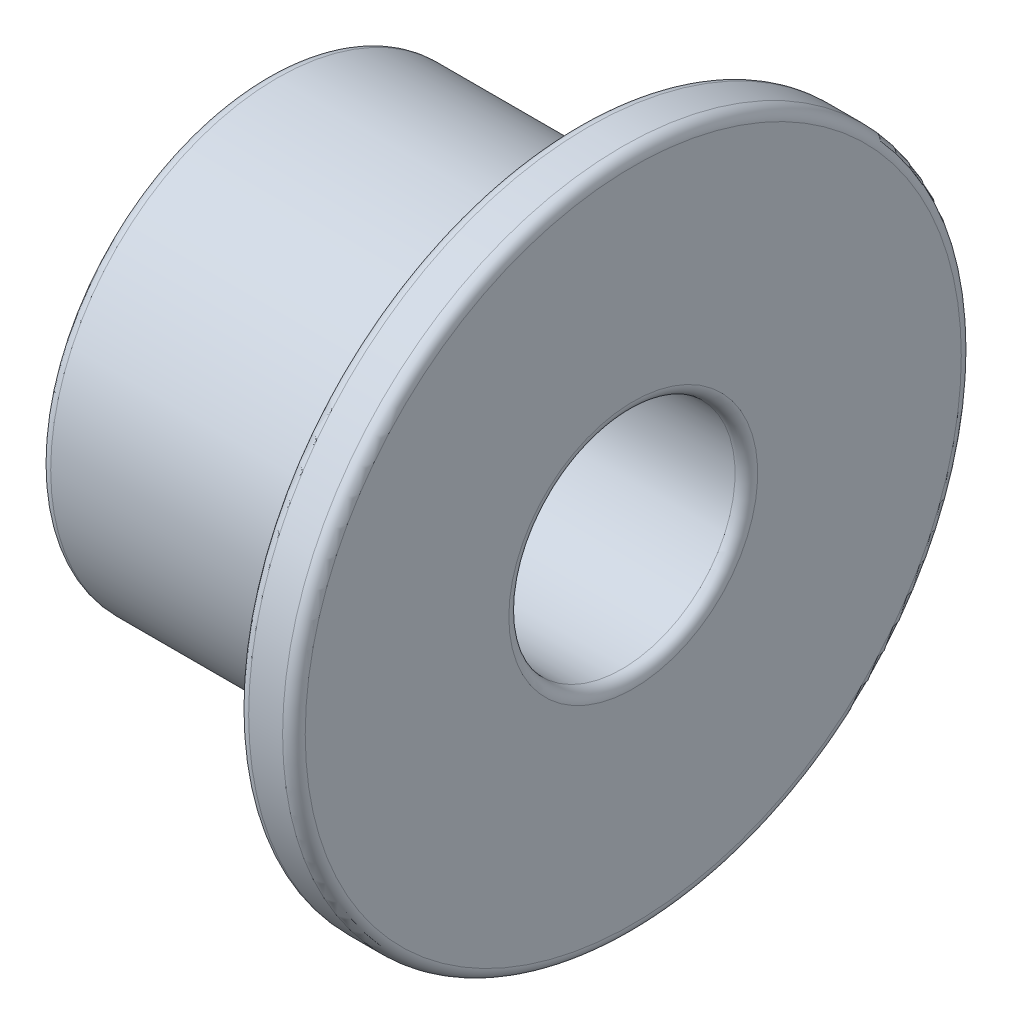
ISO-10303-21;
HEADER;
FILE_DESCRIPTION(('STEP AP214'),'2;1');
FILE_NAME('part.step','',(''),(''),'','','');
FILE_SCHEMA(('AUTOMOTIVE_DESIGN { 1 0 10303 214 1 1 1 1 }'));
ENDSEC;
DATA;
#1=APPLICATION_CONTEXT('core data for automotive mechanical design processes');
#2=APPLICATION_PROTOCOL_DEFINITION('international standard','automotive_design',2000,#1);
#3=PRODUCT_CONTEXT('',#1,'mechanical');
#4=PRODUCT('Part','Part','',(#3));
#5=PRODUCT_RELATED_PRODUCT_CATEGORY('part','',(#4));
#6=PRODUCT_DEFINITION_FORMATION('','',#4);
#7=PRODUCT_DEFINITION_CONTEXT('part definition',#1,'design');
#8=PRODUCT_DEFINITION('design','',#6,#7);
#9=PRODUCT_DEFINITION_SHAPE('','',#8);
#10=(LENGTH_UNIT() NAMED_UNIT(*) SI_UNIT(.MILLI.,.METRE.));
#11=(NAMED_UNIT(*) PLANE_ANGLE_UNIT() SI_UNIT($,.RADIAN.));
#12=(NAMED_UNIT(*) SI_UNIT($,.STERADIAN.) SOLID_ANGLE_UNIT());
#13=UNCERTAINTY_MEASURE_WITH_UNIT(LENGTH_MEASURE(1.E-05),#10,'distance_accuracy_value','');
#14=(GEOMETRIC_REPRESENTATION_CONTEXT(3) GLOBAL_UNCERTAINTY_ASSIGNED_CONTEXT((#13)) GLOBAL_UNIT_ASSIGNED_CONTEXT((#10,
#11,#12)) REPRESENTATION_CONTEXT('',''));
#15=CARTESIAN_POINT('',(0.,0.,0.));
#16=DIRECTION('',(0.,0.,1.));
#17=DIRECTION('',(1.,0.,0.));
#18=AXIS2_PLACEMENT_3D('',#15,#16,#17);
#19=CARTESIAN_POINT('',(0.,4.,0.));
#20=DIRECTION('',(1.,0.,0.));
#21=DIRECTION('',(0.,0.,-1.));
#22=AXIS2_PLACEMENT_3D('',#19,#20,#21);
#23=PLANE('',#22);
#24=CARTESIAN_POINT('',(0.,0.,0.));
#25=DIRECTION('',(1.,0.,0.));
#26=DIRECTION('',(0.,0.,-1.));
#27=AXIS2_PLACEMENT_3D('',#24,#25,#26);
#28=CIRCLE('',#27,2.2);
#29=CARTESIAN_POINT('',(0.,0.,-2.2));
#30=VERTEX_POINT('',#29);
#31=EDGE_CURVE('E60',#30,#30,#28,.T.);
#32=ORIENTED_EDGE('',*,*,#31,.T.);
#33=EDGE_LOOP('',(#32));
#34=FACE_BOUND('',#33,.T.);
#35=CARTESIAN_POINT('',(0.,0.,0.));
#36=DIRECTION('',(1.,0.,0.));
#37=DIRECTION('',(0.,0.,-1.));
#38=AXIS2_PLACEMENT_3D('',#35,#36,#37);
#39=CIRCLE('',#38,3.8);
#40=CARTESIAN_POINT('',(0.,0.,-3.8));
#41=VERTEX_POINT('',#40);
#42=EDGE_CURVE('E63',#41,#41,#39,.F.);
#43=ORIENTED_EDGE('',*,*,#42,.T.);
#44=EDGE_LOOP('',(#43));
#45=FACE_BOUND('',#44,.T.);
#46=ADVANCED_FACE('F29',(#34,#45),#23,.F.);
#47=CARTESIAN_POINT('',(0.,0.,0.));
#48=DIRECTION('',(-1.,0.,0.));
#49=DIRECTION('',(0.,0.,1.));
#50=AXIS2_PLACEMENT_3D('',#47,#48,#49);
#51=CYLINDRICAL_SURFACE('',#50,4.);
#52=CARTESIAN_POINT('',(5.3,0.,0.));
#53=DIRECTION('',(1.,0.,0.));
#54=DIRECTION('',(0.,0.,-1.));
#55=AXIS2_PLACEMENT_3D('',#52,#53,#54);
#56=CIRCLE('',#55,4.);
#57=CARTESIAN_POINT('',(5.3,0.,-4.));
#58=VERTEX_POINT('',#57);
#59=EDGE_CURVE('E48',#58,#58,#56,.F.);
#60=ORIENTED_EDGE('',*,*,#59,.T.);
#61=EDGE_LOOP('',(#60));
#62=FACE_BOUND('',#61,.T.);
#63=CARTESIAN_POINT('',(0.2,0.,0.));
#64=DIRECTION('',(1.,0.,0.));
#65=DIRECTION('',(0.,0.,-1.));
#66=AXIS2_PLACEMENT_3D('',#63,#64,#65);
#67=CIRCLE('',#66,4.);
#68=CARTESIAN_POINT('',(0.2,0.,-4.));
#69=VERTEX_POINT('',#68);
#70=EDGE_CURVE('E51',#69,#69,#67,.T.);
#71=ORIENTED_EDGE('',*,*,#70,.T.);
#72=EDGE_LOOP('',(#71));
#73=FACE_BOUND('',#72,.T.);
#74=ADVANCED_FACE('F105',(#62,#73),#51,.T.);
#75=CARTESIAN_POINT('',(5.5,6.,0.));
#76=DIRECTION('',(1.,0.,0.));
#77=DIRECTION('',(0.,0.,-1.));
#78=AXIS2_PLACEMENT_3D('',#75,#76,#77);
#79=PLANE('',#78);
#80=CARTESIAN_POINT('',(5.5,0.,0.));
#81=DIRECTION('',(1.,0.,0.));
#82=DIRECTION('',(0.,0.,-1.));
#83=AXIS2_PLACEMENT_3D('',#80,#81,#82);
#84=CIRCLE('',#83,4.2);
#85=CARTESIAN_POINT('',(5.5,0.,-4.2));
#86=VERTEX_POINT('',#85);
#87=EDGE_CURVE('E39',#86,#86,#84,.T.);
#88=ORIENTED_EDGE('',*,*,#87,.T.);
#89=EDGE_LOOP('',(#88));
#90=FACE_BOUND('',#89,.T.);
#91=CARTESIAN_POINT('',(5.5,0.,0.));
#92=DIRECTION('',(1.,0.,0.));
#93=DIRECTION('',(0.,0.,-1.));
#94=AXIS2_PLACEMENT_3D('',#91,#92,#93);
#95=CIRCLE('',#94,5.8);
#96=CARTESIAN_POINT('',(5.5,0.,-5.8));
#97=VERTEX_POINT('',#96);
#98=EDGE_CURVE('E43',#97,#97,#95,.F.);
#99=ORIENTED_EDGE('',*,*,#98,.T.);
#100=EDGE_LOOP('',(#99));
#101=FACE_BOUND('',#100,.T.);
#102=ADVANCED_FACE('F110',(#90,#101),#79,.F.);
#103=CARTESIAN_POINT('',(0.,0.,0.));
#104=DIRECTION('',(-1.,0.,0.));
#105=DIRECTION('',(0.,0.,1.));
#106=AXIS2_PLACEMENT_3D('',#103,#104,#105);
#107=CYLINDRICAL_SURFACE('',#106,6.);
#108=CARTESIAN_POINT('',(6.3,0.,0.));
#109=DIRECTION('',(-1.,0.,0.));
#110=DIRECTION('',(0.,0.,1.));
#111=AXIS2_PLACEMENT_3D('',#108,#109,#110);
#112=CIRCLE('',#111,6.);
#113=CARTESIAN_POINT('',(6.3,0.,6.));
#114=VERTEX_POINT('',#113);
#115=EDGE_CURVE('E10',#114,#114,#112,.T.);
#116=ORIENTED_EDGE('',*,*,#115,.T.);
#117=EDGE_LOOP('',(#116));
#118=FACE_BOUND('',#117,.T.);
#119=CARTESIAN_POINT('',(5.7,0.,0.));
#120=DIRECTION('',(1.,0.,0.));
#121=DIRECTION('',(0.,0.,-1.));
#122=AXIS2_PLACEMENT_3D('',#119,#120,#121);
#123=CIRCLE('',#122,6.);
#124=CARTESIAN_POINT('',(5.7,0.,-6.));
#125=VERTEX_POINT('',#124);
#126=EDGE_CURVE('E35',#125,#125,#123,.T.);
#127=ORIENTED_EDGE('',*,*,#126,.T.);
#128=EDGE_LOOP('',(#127));
#129=FACE_BOUND('',#128,.T.);
#130=ADVANCED_FACE('F86',(#118,#129),#107,.T.);
#131=CARTESIAN_POINT('',(6.5,2.,0.));
#132=DIRECTION('',(-1.,0.,0.));
#133=DIRECTION('',(0.,0.,1.));
#134=AXIS2_PLACEMENT_3D('',#131,#132,#133);
#135=PLANE('',#134);
#136=CARTESIAN_POINT('',(6.5,0.,0.));
#137=DIRECTION('',(-1.,0.,0.));
#138=DIRECTION('',(0.,0.,1.));
#139=AXIS2_PLACEMENT_3D('',#136,#137,#138);
#140=CIRCLE('',#139,2.2);
#141=CARTESIAN_POINT('',(6.5,0.,2.2));
#142=VERTEX_POINT('',#141);
#143=EDGE_CURVE('E54',#142,#142,#140,.T.);
#144=ORIENTED_EDGE('',*,*,#143,.T.);
#145=EDGE_LOOP('',(#144));
#146=FACE_BOUND('',#145,.T.);
#147=CARTESIAN_POINT('',(6.5,0.,0.));
#148=DIRECTION('',(-1.,0.,0.));
#149=DIRECTION('',(0.,0.,1.));
#150=AXIS2_PLACEMENT_3D('',#147,#148,#149);
#151=CIRCLE('',#150,5.8);
#152=CARTESIAN_POINT('',(6.5,0.,5.8));
#153=VERTEX_POINT('',#152);
#154=EDGE_CURVE('E57',#153,#153,#151,.F.);
#155=ORIENTED_EDGE('',*,*,#154,.T.);
#156=EDGE_LOOP('',(#155));
#157=FACE_BOUND('',#156,.T.);
#158=ADVANCED_FACE('F83',(#146,#157),#135,.F.);
#159=CARTESIAN_POINT('',(0.,0.,0.));
#160=DIRECTION('',(-1.,0.,0.));
#161=DIRECTION('',(0.,0.,1.));
#162=AXIS2_PLACEMENT_3D('',#159,#160,#161);
#163=CYLINDRICAL_SURFACE('',#162,2.);
#164=CARTESIAN_POINT('',(0.2,0.,0.));
#165=DIRECTION('',(1.,0.,0.));
#166=DIRECTION('',(0.,0.,-1.));
#167=AXIS2_PLACEMENT_3D('',#164,#165,#166);
#168=CIRCLE('',#167,2.);
#169=CARTESIAN_POINT('',(0.2,0.,-2.));
#170=VERTEX_POINT('',#169);
#171=EDGE_CURVE('E66',#170,#170,#168,.F.);
#172=ORIENTED_EDGE('',*,*,#171,.T.);
#173=EDGE_LOOP('',(#172));
#174=FACE_BOUND('',#173,.T.);
#175=CARTESIAN_POINT('',(6.3,0.,0.));
#176=DIRECTION('',(-1.,0.,0.));
#177=DIRECTION('',(0.,0.,1.));
#178=AXIS2_PLACEMENT_3D('',#175,#176,#177);
#179=CIRCLE('',#178,2.);
#180=CARTESIAN_POINT('',(6.3,0.,2.));
#181=VERTEX_POINT('',#180);
#182=EDGE_CURVE('E69',#181,#181,#179,.F.);
#183=ORIENTED_EDGE('',*,*,#182,.T.);
#184=EDGE_LOOP('',(#183));
#185=FACE_BOUND('',#184,.T.);
#186=ADVANCED_FACE('F73',(#174,#185),#163,.F.);
#187=CARTESIAN_POINT('',(0.2,0.,0.));
#188=DIRECTION('',(1.,0.,0.));
#189=DIRECTION('',(0.,0.,-1.));
#190=AXIS2_PLACEMENT_3D('',#187,#188,#189);
#191=TOROIDAL_SURFACE('',#190,2.2,0.2);
#192=ORIENTED_EDGE('',*,*,#31,.F.);
#193=EDGE_LOOP('',(#192));
#194=FACE_BOUND('',#193,.T.);
#195=ORIENTED_EDGE('',*,*,#171,.F.);
#196=EDGE_LOOP('',(#195));
#197=FACE_BOUND('',#196,.T.);
#198=ADVANCED_FACE('F79',(#194,#197),#191,.T.);
#199=CARTESIAN_POINT('',(6.3,0.,0.));
#200=DIRECTION('',(-1.,0.,0.));
#201=DIRECTION('',(0.,0.,1.));
#202=AXIS2_PLACEMENT_3D('',#199,#200,#201);
#203=TOROIDAL_SURFACE('',#202,2.2,0.2);
#204=ORIENTED_EDGE('',*,*,#182,.F.);
#205=EDGE_LOOP('',(#204));
#206=FACE_BOUND('',#205,.T.);
#207=ORIENTED_EDGE('',*,*,#143,.F.);
#208=EDGE_LOOP('',(#207));
#209=FACE_BOUND('',#208,.T.);
#210=ADVANCED_FACE('F75',(#206,#209),#203,.T.);
#211=CARTESIAN_POINT('',(5.3,0.,0.));
#212=DIRECTION('',(1.,0.,0.));
#213=DIRECTION('',(0.,0.,-1.));
#214=AXIS2_PLACEMENT_3D('',#211,#212,#213);
#215=TOROIDAL_SURFACE('',#214,4.2,0.2);
#216=ORIENTED_EDGE('',*,*,#87,.F.);
#217=EDGE_LOOP('',(#216));
#218=FACE_BOUND('',#217,.T.);
#219=ORIENTED_EDGE('',*,*,#59,.F.);
#220=EDGE_LOOP('',(#219));
#221=FACE_BOUND('',#220,.T.);
#222=ADVANCED_FACE('F78',(#218,#221),#215,.F.);
#223=CARTESIAN_POINT('',(0.2,0.,0.));
#224=DIRECTION('',(1.,0.,0.));
#225=DIRECTION('',(0.,0.,-1.));
#226=AXIS2_PLACEMENT_3D('',#223,#224,#225);
#227=TOROIDAL_SURFACE('',#226,3.8,0.2);
#228=ORIENTED_EDGE('',*,*,#70,.F.);
#229=EDGE_LOOP('',(#228));
#230=FACE_BOUND('',#229,.T.);
#231=ORIENTED_EDGE('',*,*,#42,.F.);
#232=EDGE_LOOP('',(#231));
#233=FACE_BOUND('',#232,.T.);
#234=ADVANCED_FACE('F94',(#230,#233),#227,.T.);
#235=CARTESIAN_POINT('',(6.3,0.,0.));
#236=DIRECTION('',(-1.,0.,0.));
#237=DIRECTION('',(0.,0.,1.));
#238=AXIS2_PLACEMENT_3D('',#235,#236,#237);
#239=TOROIDAL_SURFACE('',#238,5.8,0.2);
#240=ORIENTED_EDGE('',*,*,#154,.F.);
#241=EDGE_LOOP('',(#240));
#242=FACE_BOUND('',#241,.T.);
#243=ORIENTED_EDGE('',*,*,#115,.F.);
#244=EDGE_LOOP('',(#243));
#245=FACE_BOUND('',#244,.T.);
#246=ADVANCED_FACE('F90',(#242,#245),#239,.T.);
#247=CARTESIAN_POINT('',(5.7,0.,0.));
#248=DIRECTION('',(1.,0.,0.));
#249=DIRECTION('',(0.,0.,-1.));
#250=AXIS2_PLACEMENT_3D('',#247,#248,#249);
#251=TOROIDAL_SURFACE('',#250,5.8,0.2);
#252=ORIENTED_EDGE('',*,*,#126,.F.);
#253=EDGE_LOOP('',(#252));
#254=FACE_BOUND('',#253,.T.);
#255=ORIENTED_EDGE('',*,*,#98,.F.);
#256=EDGE_LOOP('',(#255));
#257=FACE_BOUND('',#256,.T.);
#258=ADVANCED_FACE('F93',(#254,#257),#251,.T.);
#259=CLOSED_SHELL('',(#46,#74,#102,#130,#158,#186,#198,#210,#222,#234,#246,#258));
#260=MANIFOLD_SOLID_BREP('B2',#259);
#261=ADVANCED_BREP_SHAPE_REPRESENTATION('',(#18,#260),#14);
#262=SHAPE_DEFINITION_REPRESENTATION(#9,#261);
ENDSEC;
END-ISO-10303-21;
